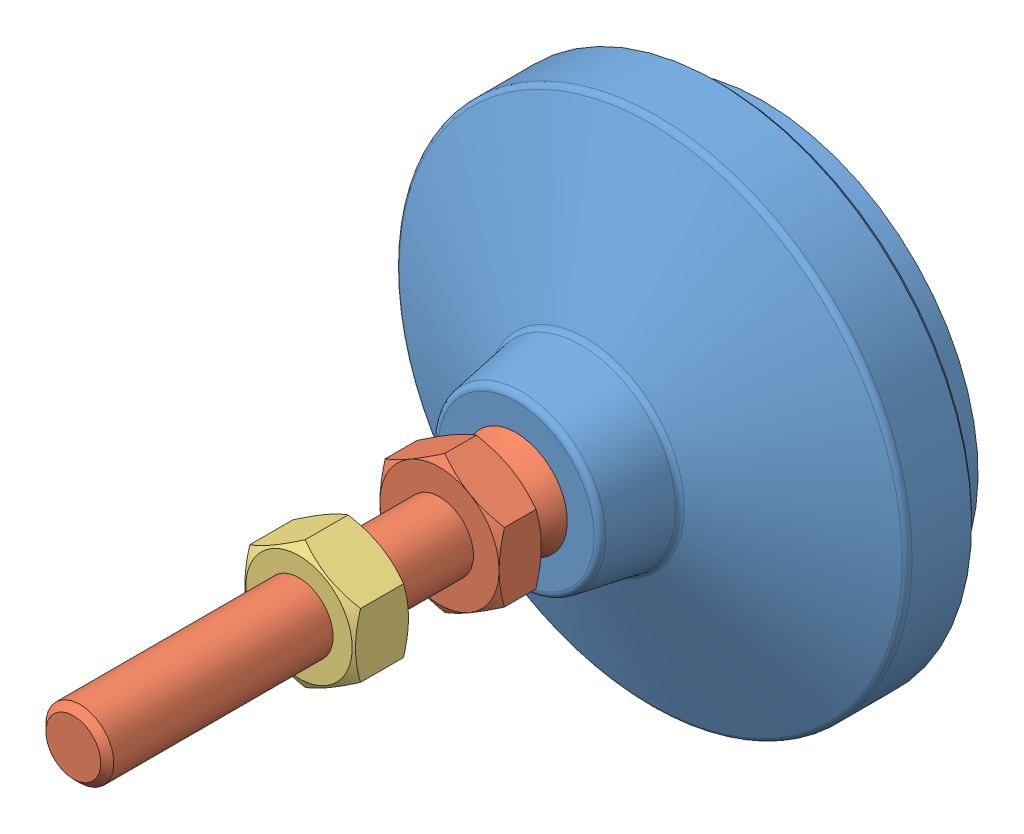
SolidWorks assembly LSVA50-M8X43-SUS.sldasm, configuration Default (file format 15000). Lengths in mm.
Overall size (60 60 81).
3 component instances, 3 part files, 0 mates.
Components (placement in the parent):
- LSVA50-M8X43-SUS_01-1: LSVA50-M8X43-SUS_01.sldprt [Default] at (0 0 5) x (1 0 0) z (0 -1 0) size (60 29 60)
- LSVA50-M8X43-SUS_02-1: LSVA50-M8X43-SUS_02.sldprt [Default] at (0 0 25.4) x (1 0 0) z (0 -1 0) size (14 62.6 16.17)
- LSVA50-M8X43-SUS_03-1: LSVA50-M8X43-SUS_03.sldprt [Default] at (0 0 48) size (13 15.01 6.5)
